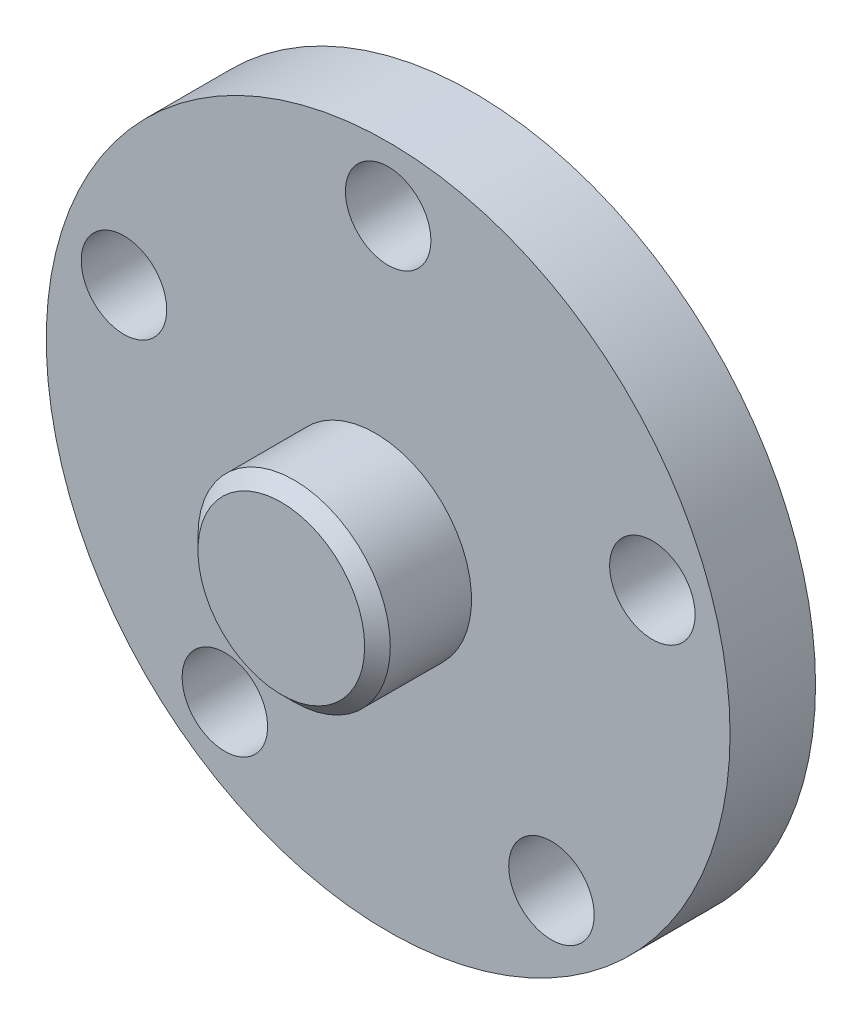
ISO-10303-21;
HEADER;
FILE_DESCRIPTION(('STEP AP214'),'2;1');
FILE_NAME('part.step','',(''),(''),'','','');
FILE_SCHEMA(('AUTOMOTIVE_DESIGN { 1 0 10303 214 1 1 1 1 }'));
ENDSEC;
DATA;
#1=APPLICATION_CONTEXT('core data for automotive mechanical design processes');
#2=APPLICATION_PROTOCOL_DEFINITION('international standard','automotive_design',2000,#1);
#3=PRODUCT_CONTEXT('',#1,'mechanical');
#4=PRODUCT('Part','Part','',(#3));
#5=PRODUCT_RELATED_PRODUCT_CATEGORY('part','',(#4));
#6=PRODUCT_DEFINITION_FORMATION('','',#4);
#7=PRODUCT_DEFINITION_CONTEXT('part definition',#1,'design');
#8=PRODUCT_DEFINITION('design','',#6,#7);
#9=PRODUCT_DEFINITION_SHAPE('','',#8);
#10=(LENGTH_UNIT() NAMED_UNIT(*) SI_UNIT(.MILLI.,.METRE.));
#11=(NAMED_UNIT(*) PLANE_ANGLE_UNIT() SI_UNIT($,.RADIAN.));
#12=(NAMED_UNIT(*) SI_UNIT($,.STERADIAN.) SOLID_ANGLE_UNIT());
#13=UNCERTAINTY_MEASURE_WITH_UNIT(LENGTH_MEASURE(1.E-05),#10,'distance_accuracy_value','');
#14=(GEOMETRIC_REPRESENTATION_CONTEXT(3) GLOBAL_UNCERTAINTY_ASSIGNED_CONTEXT((#13)) GLOBAL_UNIT_ASSIGNED_CONTEXT((#10,
#11,#12)) REPRESENTATION_CONTEXT('',''));
#15=CARTESIAN_POINT('',(0.,0.,0.));
#16=DIRECTION('',(0.,0.,1.));
#17=DIRECTION('',(1.,0.,0.));
#18=AXIS2_PLACEMENT_3D('',#15,#16,#17);
#19=CARTESIAN_POINT('',(0.,0.,20.));
#20=DIRECTION('',(0.,0.,-1.));
#21=DIRECTION('',(-1.,0.,0.));
#22=AXIS2_PLACEMENT_3D('',#19,#20,#21);
#23=CYLINDRICAL_SURFACE('',#22,80.);
#24=CARTESIAN_POINT('',(0.,0.,20.));
#25=DIRECTION('',(0.,0.,1.));
#26=DIRECTION('',(1.,0.,0.));
#27=AXIS2_PLACEMENT_3D('',#24,#25,#26);
#28=CIRCLE('',#27,80.);
#29=CARTESIAN_POINT('',(80.,0.,20.));
#30=VERTEX_POINT('',#29);
#31=EDGE_CURVE('E40',#30,#30,#28,.T.);
#32=ORIENTED_EDGE('',*,*,#31,.F.);
#33=EDGE_LOOP('',(#32));
#34=FACE_BOUND('',#33,.T.);
#35=CARTESIAN_POINT('',(0.,0.,0.));
#36=DIRECTION('',(0.,0.,1.));
#37=DIRECTION('',(1.,0.,0.));
#38=AXIS2_PLACEMENT_3D('',#35,#36,#37);
#39=CIRCLE('',#38,80.);
#40=CARTESIAN_POINT('',(80.,0.,0.));
#41=VERTEX_POINT('',#40);
#42=EDGE_CURVE('E45',#41,#41,#39,.T.);
#43=ORIENTED_EDGE('',*,*,#42,.T.);
#44=EDGE_LOOP('',(#43));
#45=FACE_BOUND('',#44,.T.);
#46=ADVANCED_FACE('F26',(#34,#45),#23,.T.);
#47=CARTESIAN_POINT('',(0.,0.,20.));
#48=DIRECTION('',(0.,0.,1.));
#49=DIRECTION('',(1.,0.,0.));
#50=AXIS2_PLACEMENT_3D('',#47,#48,#49);
#51=PLANE('',#50);
#52=CARTESIAN_POINT('',(61.8186735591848,20.0861046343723,20.));
#53=DIRECTION('',(0.,0.,1.));
#54=DIRECTION('',(0.309016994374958,-0.95105651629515,0.));
#55=AXIS2_PLACEMENT_3D('',#52,#53,#54);
#56=CIRCLE('',#55,10.);
#57=CARTESIAN_POINT('',(64.9088435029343,10.5755394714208,20.));
#58=VERTEX_POINT('',#57);
#59=EDGE_CURVE('E81',#58,#58,#56,.T.);
#60=ORIENTED_EDGE('',*,*,#59,.F.);
#61=EDGE_LOOP('',(#60));
#62=FACE_BOUND('',#61,.T.);
#63=CARTESIAN_POINT('',(38.2060413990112,-52.5861046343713,20.));
#64=DIRECTION('',(0.,0.,1.));
#65=DIRECTION('',(-0.809016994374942,-0.58778525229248,0.));
#66=AXIS2_PLACEMENT_3D('',#63,#64,#65);
#67=CIRCLE('',#66,10.);
#68=CARTESIAN_POINT('',(30.1158714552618,-58.4639571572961,20.));
#69=VERTEX_POINT('',#68);
#70=EDGE_CURVE('E75',#69,#69,#67,.T.);
#71=ORIENTED_EDGE('',*,*,#70,.F.);
#72=EDGE_LOOP('',(#71));
#73=FACE_BOUND('',#72,.T.);
#74=CARTESIAN_POINT('',(-38.2060413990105,-52.5861046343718,20.));
#75=DIRECTION('',(0.,0.,1.));
#76=DIRECTION('',(-0.809016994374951,0.587785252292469,0.));
#77=AXIS2_PLACEMENT_3D('',#74,#75,#76);
#78=CIRCLE('',#77,10.);
#79=CARTESIAN_POINT('',(-46.29621134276,-46.7082521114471,20.));
#80=VERTEX_POINT('',#79);
#81=EDGE_CURVE('E69',#80,#80,#78,.T.);
#82=ORIENTED_EDGE('',*,*,#81,.F.);
#83=EDGE_LOOP('',(#82));
#84=FACE_BOUND('',#83,.T.);
#85=CARTESIAN_POINT('',(-61.818673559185,20.0861046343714,20.));
#86=DIRECTION('',(0.,0.,1.));
#87=DIRECTION('',(0.309016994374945,0.951056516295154,0.));
#88=AXIS2_PLACEMENT_3D('',#85,#86,#87);
#89=CIRCLE('',#88,10.);
#90=CARTESIAN_POINT('',(-58.7285036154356,29.5966697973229,20.));
#91=VERTEX_POINT('',#90);
#92=EDGE_CURVE('E63',#91,#91,#89,.T.);
#93=ORIENTED_EDGE('',*,*,#92,.F.);
#94=EDGE_LOOP('',(#93));
#95=FACE_BOUND('',#94,.T.);
#96=CARTESIAN_POINT('',(0.,65.,20.));
#97=DIRECTION('',(0.,0.,1.));
#98=DIRECTION('',(1.,0.,0.));
#99=AXIS2_PLACEMENT_3D('',#96,#97,#98);
#100=CIRCLE('',#99,10.);
#101=CARTESIAN_POINT('',(10.,65.,20.));
#102=VERTEX_POINT('',#101);
#103=EDGE_CURVE('E57',#102,#102,#100,.T.);
#104=ORIENTED_EDGE('',*,*,#103,.F.);
#105=EDGE_LOOP('',(#104));
#106=FACE_BOUND('',#105,.T.);
#107=CARTESIAN_POINT('',(0.,0.,20.));
#108=DIRECTION('',(0.,0.,1.));
#109=DIRECTION('',(1.,0.,0.));
#110=AXIS2_PLACEMENT_3D('',#107,#108,#109);
#111=CIRCLE('',#110,10.);
#112=CARTESIAN_POINT('',(10.,0.,20.));
#113=VERTEX_POINT('',#112);
#114=EDGE_CURVE('E36',#113,#113,#111,.T.);
#115=ORIENTED_EDGE('',*,*,#114,.F.);
#116=EDGE_LOOP('',(#115));
#117=FACE_BOUND('',#116,.T.);
#118=ORIENTED_EDGE('',*,*,#31,.T.);
#119=EDGE_LOOP('',(#118));
#120=FACE_BOUND('',#119,.T.);
#121=ADVANCED_FACE('F87',(#62,#73,#84,#95,#106,#117,#120),#51,.T.);
#122=CARTESIAN_POINT('',(0.,0.,0.));
#123=DIRECTION('',(0.,0.,1.));
#124=DIRECTION('',(1.,0.,0.));
#125=AXIS2_PLACEMENT_3D('',#122,#123,#124);
#126=PLANE('',#125);
#127=CARTESIAN_POINT('',(61.8186735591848,20.0861046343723,0.));
#128=DIRECTION('',(0.,0.,1.));
#129=DIRECTION('',(0.309016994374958,-0.95105651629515,0.));
#130=AXIS2_PLACEMENT_3D('',#127,#128,#129);
#131=CIRCLE('',#130,10.);
#132=CARTESIAN_POINT('',(64.9088435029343,10.5755394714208,0.));
#133=VERTEX_POINT('',#132);
#134=EDGE_CURVE('E78',#133,#133,#131,.T.);
#135=ORIENTED_EDGE('',*,*,#134,.T.);
#136=EDGE_LOOP('',(#135));
#137=FACE_BOUND('',#136,.T.);
#138=CARTESIAN_POINT('',(38.2060413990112,-52.5861046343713,0.));
#139=DIRECTION('',(0.,0.,1.));
#140=DIRECTION('',(-0.809016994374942,-0.58778525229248,0.));
#141=AXIS2_PLACEMENT_3D('',#138,#139,#140);
#142=CIRCLE('',#141,10.);
#143=CARTESIAN_POINT('',(30.1158714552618,-58.4639571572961,0.));
#144=VERTEX_POINT('',#143);
#145=EDGE_CURVE('E72',#144,#144,#142,.T.);
#146=ORIENTED_EDGE('',*,*,#145,.T.);
#147=EDGE_LOOP('',(#146));
#148=FACE_BOUND('',#147,.T.);
#149=CARTESIAN_POINT('',(-38.2060413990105,-52.5861046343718,0.));
#150=DIRECTION('',(0.,0.,1.));
#151=DIRECTION('',(-0.809016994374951,0.587785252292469,0.));
#152=AXIS2_PLACEMENT_3D('',#149,#150,#151);
#153=CIRCLE('',#152,10.);
#154=CARTESIAN_POINT('',(-46.29621134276,-46.7082521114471,0.));
#155=VERTEX_POINT('',#154);
#156=EDGE_CURVE('E66',#155,#155,#153,.T.);
#157=ORIENTED_EDGE('',*,*,#156,.T.);
#158=EDGE_LOOP('',(#157));
#159=FACE_BOUND('',#158,.T.);
#160=CARTESIAN_POINT('',(-61.818673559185,20.0861046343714,0.));
#161=DIRECTION('',(0.,0.,1.));
#162=DIRECTION('',(0.309016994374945,0.951056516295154,0.));
#163=AXIS2_PLACEMENT_3D('',#160,#161,#162);
#164=CIRCLE('',#163,10.);
#165=CARTESIAN_POINT('',(-58.7285036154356,29.5966697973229,0.));
#166=VERTEX_POINT('',#165);
#167=EDGE_CURVE('E60',#166,#166,#164,.T.);
#168=ORIENTED_EDGE('',*,*,#167,.T.);
#169=EDGE_LOOP('',(#168));
#170=FACE_BOUND('',#169,.T.);
#171=CARTESIAN_POINT('',(0.,65.,0.));
#172=DIRECTION('',(0.,0.,1.));
#173=DIRECTION('',(1.,0.,0.));
#174=AXIS2_PLACEMENT_3D('',#171,#172,#173);
#175=CIRCLE('',#174,10.);
#176=CARTESIAN_POINT('',(10.,65.,0.));
#177=VERTEX_POINT('',#176);
#178=EDGE_CURVE('E54',#177,#177,#175,.T.);
#179=ORIENTED_EDGE('',*,*,#178,.T.);
#180=EDGE_LOOP('',(#179));
#181=FACE_BOUND('',#180,.T.);
#182=ORIENTED_EDGE('',*,*,#42,.F.);
#183=EDGE_LOOP('',(#182));
#184=FACE_BOUND('',#183,.T.);
#185=ADVANCED_FACE('F90',(#137,#148,#159,#170,#181,#184),#126,.F.);
#186=CARTESIAN_POINT('',(-22.5,0.,45.));
#187=DIRECTION('',(0.,0.,1.));
#188=DIRECTION('',(1.,0.,0.));
#189=AXIS2_PLACEMENT_3D('',#186,#187,#188);
#190=PLANE('',#189);
#191=CARTESIAN_POINT('',(0.,0.,45.));
#192=DIRECTION('',(0.,0.,1.));
#193=DIRECTION('',(1.,0.,0.));
#194=AXIS2_PLACEMENT_3D('',#191,#192,#193);
#195=CIRCLE('',#194,19.5);
#196=CARTESIAN_POINT('',(19.5,0.,45.));
#197=VERTEX_POINT('',#196);
#198=EDGE_CURVE('E10',#197,#197,#195,.T.);
#199=ORIENTED_EDGE('',*,*,#198,.T.);
#200=EDGE_LOOP('',(#199));
#201=FACE_BOUND('',#200,.T.);
#202=ADVANCED_FACE('F108',(#201),#190,.T.);
#203=CARTESIAN_POINT('',(0.,0.,0.));
#204=DIRECTION('',(0.,0.,-1.));
#205=DIRECTION('',(-1.,0.,0.));
#206=AXIS2_PLACEMENT_3D('',#203,#204,#205);
#207=CYLINDRICAL_SURFACE('',#206,22.5);
#208=CARTESIAN_POINT('',(0.,0.,42.));
#209=DIRECTION('',(0.,0.,1.));
#210=DIRECTION('',(1.,0.,0.));
#211=AXIS2_PLACEMENT_3D('',#208,#209,#210);
#212=CIRCLE('',#211,22.5);
#213=CARTESIAN_POINT('',(22.5,0.,42.));
#214=VERTEX_POINT('',#213);
#215=EDGE_CURVE('E32',#214,#214,#212,.F.);
#216=ORIENTED_EDGE('',*,*,#215,.T.);
#217=EDGE_LOOP('',(#216));
#218=FACE_BOUND('',#217,.T.);
#219=CARTESIAN_POINT('',(0.,0.,23.));
#220=DIRECTION('',(0.,0.,-1.));
#221=DIRECTION('',(-1.,0.,0.));
#222=AXIS2_PLACEMENT_3D('',#219,#220,#221);
#223=CIRCLE('',#222,22.5);
#224=CARTESIAN_POINT('',(-22.5,0.,23.));
#225=VERTEX_POINT('',#224);
#226=EDGE_CURVE('E48',#225,#225,#223,.T.);
#227=ORIENTED_EDGE('',*,*,#226,.F.);
#228=EDGE_LOOP('',(#227));
#229=FACE_BOUND('',#228,.T.);
#230=ADVANCED_FACE('F115',(#218,#229),#207,.T.);
#231=CARTESIAN_POINT('',(-10.,0.,23.));
#232=DIRECTION('',(0.,0.,-1.));
#233=DIRECTION('',(-1.,0.,0.));
#234=AXIS2_PLACEMENT_3D('',#231,#232,#233);
#235=PLANE('',#234);
#236=ORIENTED_EDGE('',*,*,#226,.T.);
#237=EDGE_LOOP('',(#236));
#238=FACE_BOUND('',#237,.T.);
#239=CARTESIAN_POINT('',(0.,0.,23.));
#240=DIRECTION('',(0.,0.,-1.));
#241=DIRECTION('',(-1.,0.,0.));
#242=AXIS2_PLACEMENT_3D('',#239,#240,#241);
#243=CIRCLE('',#242,10.);
#244=CARTESIAN_POINT('',(-10.,0.,23.));
#245=VERTEX_POINT('',#244);
#246=EDGE_CURVE('E51',#245,#245,#243,.T.);
#247=ORIENTED_EDGE('',*,*,#246,.F.);
#248=EDGE_LOOP('',(#247));
#249=FACE_BOUND('',#248,.T.);
#250=ADVANCED_FACE('F121',(#238,#249),#235,.T.);
#251=CARTESIAN_POINT('',(0.,0.,0.));
#252=DIRECTION('',(0.,0.,-1.));
#253=DIRECTION('',(-1.,0.,0.));
#254=AXIS2_PLACEMENT_3D('',#251,#252,#253);
#255=CYLINDRICAL_SURFACE('',#254,10.);
#256=ORIENTED_EDGE('',*,*,#246,.T.);
#257=EDGE_LOOP('',(#256));
#258=FACE_BOUND('',#257,.T.);
#259=ORIENTED_EDGE('',*,*,#114,.T.);
#260=EDGE_LOOP('',(#259));
#261=FACE_BOUND('',#260,.T.);
#262=ADVANCED_FACE('F124',(#258,#261),#255,.T.);
#263=CARTESIAN_POINT('',(0.,0.,42.));
#264=DIRECTION('',(0.,0.,-1.));
#265=DIRECTION('',(-1.,0.,0.));
#266=AXIS2_PLACEMENT_3D('',#263,#264,#265);
#267=CONICAL_SURFACE('',#266,22.5,0.785398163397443);
#268=ORIENTED_EDGE('',*,*,#198,.F.);
#269=EDGE_LOOP('',(#268));
#270=FACE_BOUND('',#269,.T.);
#271=ORIENTED_EDGE('',*,*,#215,.F.);
#272=EDGE_LOOP('',(#271));
#273=FACE_BOUND('',#272,.T.);
#274=ADVANCED_FACE('F128',(#270,#273),#267,.T.);
#275=CARTESIAN_POINT('',(0.,65.,0.));
#276=DIRECTION('',(0.,0.,1.));
#277=DIRECTION('',(1.,0.,0.));
#278=AXIS2_PLACEMENT_3D('',#275,#276,#277);
#279=CYLINDRICAL_SURFACE('',#278,10.);
#280=ORIENTED_EDGE('',*,*,#178,.F.);
#281=EDGE_LOOP('',(#280));
#282=FACE_BOUND('',#281,.T.);
#283=ORIENTED_EDGE('',*,*,#103,.T.);
#284=EDGE_LOOP('',(#283));
#285=FACE_BOUND('',#284,.T.);
#286=ADVANCED_FACE('F132',(#282,#285),#279,.F.);
#287=CARTESIAN_POINT('',(-61.818673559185,20.0861046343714,0.));
#288=DIRECTION('',(0.,0.,1.));
#289=DIRECTION('',(1.,0.,0.));
#290=AXIS2_PLACEMENT_3D('',#287,#288,#289);
#291=CYLINDRICAL_SURFACE('',#290,10.);
#292=ORIENTED_EDGE('',*,*,#167,.F.);
#293=EDGE_LOOP('',(#292));
#294=FACE_BOUND('',#293,.T.);
#295=ORIENTED_EDGE('',*,*,#92,.T.);
#296=EDGE_LOOP('',(#295));
#297=FACE_BOUND('',#296,.T.);
#298=ADVANCED_FACE('F136',(#294,#297),#291,.F.);
#299=CARTESIAN_POINT('',(-38.2060413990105,-52.5861046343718,0.));
#300=DIRECTION('',(0.,0.,1.));
#301=DIRECTION('',(1.,0.,0.));
#302=AXIS2_PLACEMENT_3D('',#299,#300,#301);
#303=CYLINDRICAL_SURFACE('',#302,10.);
#304=ORIENTED_EDGE('',*,*,#156,.F.);
#305=EDGE_LOOP('',(#304));
#306=FACE_BOUND('',#305,.T.);
#307=ORIENTED_EDGE('',*,*,#81,.T.);
#308=EDGE_LOOP('',(#307));
#309=FACE_BOUND('',#308,.T.);
#310=ADVANCED_FACE('F139',(#306,#309),#303,.F.);
#311=CARTESIAN_POINT('',(38.2060413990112,-52.5861046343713,0.));
#312=DIRECTION('',(0.,0.,1.));
#313=DIRECTION('',(1.,0.,0.));
#314=AXIS2_PLACEMENT_3D('',#311,#312,#313);
#315=CYLINDRICAL_SURFACE('',#314,10.);
#316=ORIENTED_EDGE('',*,*,#145,.F.);
#317=EDGE_LOOP('',(#316));
#318=FACE_BOUND('',#317,.T.);
#319=ORIENTED_EDGE('',*,*,#70,.T.);
#320=EDGE_LOOP('',(#319));
#321=FACE_BOUND('',#320,.T.);
#322=ADVANCED_FACE('F143',(#318,#321),#315,.F.);
#323=CARTESIAN_POINT('',(61.8186735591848,20.0861046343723,0.));
#324=DIRECTION('',(0.,0.,1.));
#325=DIRECTION('',(1.,0.,0.));
#326=AXIS2_PLACEMENT_3D('',#323,#324,#325);
#327=CYLINDRICAL_SURFACE('',#326,10.);
#328=ORIENTED_EDGE('',*,*,#134,.F.);
#329=EDGE_LOOP('',(#328));
#330=FACE_BOUND('',#329,.T.);
#331=ORIENTED_EDGE('',*,*,#59,.T.);
#332=EDGE_LOOP('',(#331));
#333=FACE_BOUND('',#332,.T.);
#334=ADVANCED_FACE('F85',(#330,#333),#327,.F.);
#335=CLOSED_SHELL('',(#46,#121,#185,#202,#230,#250,#262,#274,#286,#298,#310,#322,#334));
#336=MANIFOLD_SOLID_BREP('B2',#335);
#337=ADVANCED_BREP_SHAPE_REPRESENTATION('',(#18,#336),#14);
#338=SHAPE_DEFINITION_REPRESENTATION(#9,#337);
ENDSEC;
END-ISO-10303-21;
